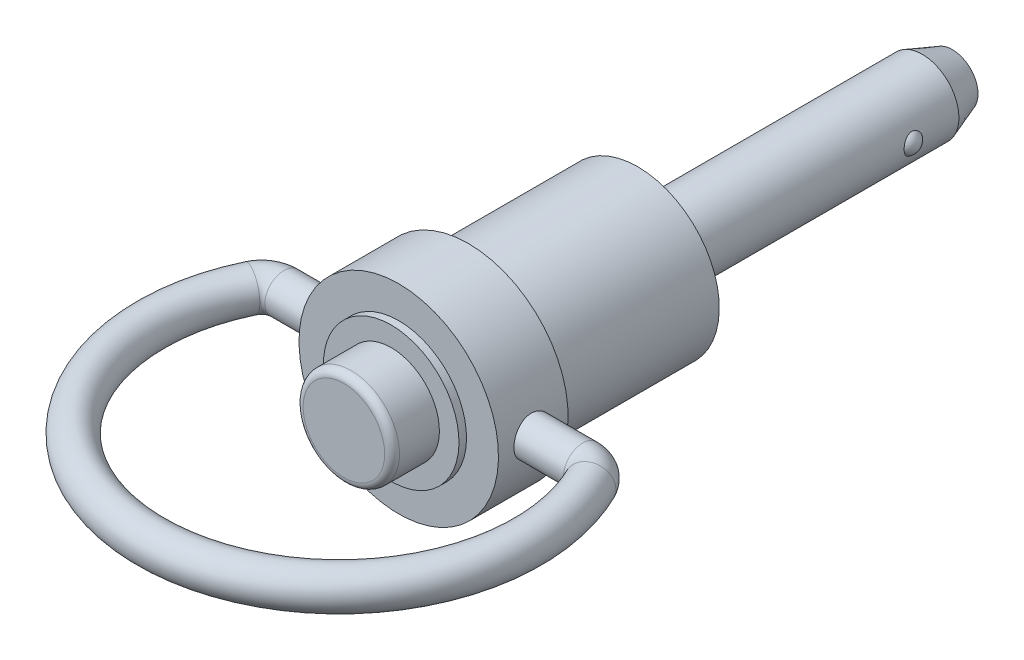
ISO-10303-21;
HEADER;
FILE_DESCRIPTION(('STEP AP214'),'2;1');
FILE_NAME('part.step','',(''),(''),'','','');
FILE_SCHEMA(('AUTOMOTIVE_DESIGN { 1 0 10303 214 1 1 1 1 }'));
ENDSEC;
DATA;
#1=APPLICATION_CONTEXT('core data for automotive mechanical design processes');
#2=APPLICATION_PROTOCOL_DEFINITION('international standard','automotive_design',2000,#1);
#3=PRODUCT_CONTEXT('',#1,'mechanical');
#4=PRODUCT('Part','Part','',(#3));
#5=PRODUCT_RELATED_PRODUCT_CATEGORY('part','',(#4));
#6=PRODUCT_DEFINITION_FORMATION('','',#4);
#7=PRODUCT_DEFINITION_CONTEXT('part definition',#1,'design');
#8=PRODUCT_DEFINITION('design','',#6,#7);
#9=PRODUCT_DEFINITION_SHAPE('','',#8);
#10=(LENGTH_UNIT() NAMED_UNIT(*) SI_UNIT(.MILLI.,.METRE.));
#11=(NAMED_UNIT(*) PLANE_ANGLE_UNIT() SI_UNIT($,.RADIAN.));
#12=(NAMED_UNIT(*) SI_UNIT($,.STERADIAN.) SOLID_ANGLE_UNIT());
#13=UNCERTAINTY_MEASURE_WITH_UNIT(LENGTH_MEASURE(1.E-05),#10,'distance_accuracy_value','');
#14=(GEOMETRIC_REPRESENTATION_CONTEXT(3) GLOBAL_UNCERTAINTY_ASSIGNED_CONTEXT((#13)) GLOBAL_UNIT_ASSIGNED_CONTEXT((#10,
#11,#12)) REPRESENTATION_CONTEXT('',''));
#15=CARTESIAN_POINT('',(0.,0.,0.));
#16=DIRECTION('',(0.,0.,1.));
#17=DIRECTION('',(1.,0.,0.));
#18=AXIS2_PLACEMENT_3D('',#15,#16,#17);
#19=CARTESIAN_POINT('',(0.,0.,19.828));
#20=DIRECTION('',(0.,0.,-1.));
#21=DIRECTION('',(-1.,0.,0.));
#22=AXIS2_PLACEMENT_3D('',#19,#20,#21);
#23=PLANE('',#22);
#24=CARTESIAN_POINT('',(0.,0.,19.828));
#25=DIRECTION('',(0.,0.,1.));
#26=DIRECTION('',(1.,0.,0.));
#27=AXIS2_PLACEMENT_3D('',#24,#25,#26);
#28=CIRCLE('',#27,2.7512);
#29=CARTESIAN_POINT('',(2.7512,0.,19.828));
#30=VERTEX_POINT('',#29);
#31=EDGE_CURVE('E211',#30,#30,#28,.T.);
#32=ORIENTED_EDGE('',*,*,#31,.T.);
#33=EDGE_LOOP('',(#32));
#34=FACE_BOUND('',#33,.T.);
#35=ADVANCED_FACE('F13',(#34),#23,.F.);
#36=CARTESIAN_POINT('',(0.,0.,19.328));
#37=DIRECTION('',(0.,0.,1.));
#38=DIRECTION('',(1.,0.,0.));
#39=AXIS2_PLACEMENT_3D('',#36,#37,#38);
#40=TOROIDAL_SURFACE('',#39,2.7512,0.5);
#41=ORIENTED_EDGE('',*,*,#31,.F.);
#42=EDGE_LOOP('',(#41));
#43=FACE_BOUND('',#42,.T.);
#44=CARTESIAN_POINT('',(0.,0.,19.328));
#45=DIRECTION('',(0.,0.,1.));
#46=DIRECTION('',(1.,0.,0.));
#47=AXIS2_PLACEMENT_3D('',#44,#45,#46);
#48=CIRCLE('',#47,3.2512);
#49=CARTESIAN_POINT('',(3.2512,0.,19.328));
#50=VERTEX_POINT('',#49);
#51=EDGE_CURVE('E103',#50,#50,#48,.T.);
#52=ORIENTED_EDGE('',*,*,#51,.T.);
#53=EDGE_LOOP('',(#52));
#54=FACE_BOUND('',#53,.T.);
#55=ADVANCED_FACE('F69',(#43,#54),#40,.T.);
#56=CARTESIAN_POINT('',(0.,0.,20.828));
#57=DIRECTION('',(0.,0.,-1.));
#58=DIRECTION('',(0.,1.,0.));
#59=AXIS2_PLACEMENT_3D('',#56,#57,#58);
#60=CYLINDRICAL_SURFACE('',#59,3.2512);
#61=CARTESIAN_POINT('',(0.,0.,16.637));
#62=DIRECTION('',(0.,0.,-1.));
#63=DIRECTION('',(0.,1.,0.));
#64=AXIS2_PLACEMENT_3D('',#61,#62,#63);
#65=CIRCLE('',#64,3.2512);
#66=CARTESIAN_POINT('',(0.,3.2512,16.637));
#67=VERTEX_POINT('',#66);
#68=EDGE_CURVE('E145',#67,#67,#65,.T.);
#69=ORIENTED_EDGE('',*,*,#68,.F.);
#70=EDGE_LOOP('',(#69));
#71=FACE_BOUND('',#70,.T.);
#72=ORIENTED_EDGE('',*,*,#51,.F.);
#73=EDGE_LOOP('',(#72));
#74=FACE_BOUND('',#73,.T.);
#75=ADVANCED_FACE('F75',(#71,#74),#60,.T.);
#76=CARTESIAN_POINT('',(0.,0.,20.1422));
#77=DIRECTION('',(0.,1.,0.));
#78=DIRECTION('',(-1.,0.,0.));
#79=AXIS2_PLACEMENT_3D('',#76,#77,#78);
#80=TOROIDAL_SURFACE('',#79,12.7,1.2954);
#81=CARTESIAN_POINT('',(-11.4549005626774,0.,14.6581090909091));
#82=DIRECTION('',(-0.43181818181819,0.,0.901960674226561));
#83=DIRECTION('',(-0.901960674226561,0.,-0.43181818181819));
#84=AXIS2_PLACEMENT_3D('',#81,#82,#83);
#85=CIRCLE('',#84,1.2954);
#86=CARTESIAN_POINT('',(-12.6233004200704,0.,14.0987318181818));
#87=VERTEX_POINT('',#86);
#88=EDGE_CURVE('E164',#87,#87,#85,.F.);
#89=ORIENTED_EDGE('',*,*,#88,.F.);
#90=EDGE_LOOP('',(#89));
#91=FACE_BOUND('',#90,.T.);
#92=CARTESIAN_POINT('',(11.4549005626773,0.,14.658109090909));
#93=DIRECTION('',(-0.431818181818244,0.,-0.901960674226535));
#94=DIRECTION('',(0.901960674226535,0.,-0.431818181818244));
#95=AXIS2_PLACEMENT_3D('',#92,#93,#94);
#96=CIRCLE('',#95,1.2954);
#97=CARTESIAN_POINT('',(12.6233004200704,0.,14.0987318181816));
#98=VERTEX_POINT('',#97);
#99=EDGE_CURVE('E161',#98,#98,#96,.T.);
#100=ORIENTED_EDGE('',*,*,#99,.F.);
#101=EDGE_LOOP('',(#100));
#102=FACE_BOUND('',#101,.T.);
#103=ADVANCED_FACE('F84',(#91,#102),#80,.T.);
#104=CARTESIAN_POINT('',(4.572,0.,16.637));
#105=DIRECTION('',(0.,0.,1.));
#106=DIRECTION('',(0.,-1.,0.));
#107=AXIS2_PLACEMENT_3D('',#104,#105,#106);
#108=PLANE('',#107);
#109=ORIENTED_EDGE('',*,*,#68,.T.);
#110=EDGE_LOOP('',(#109));
#111=FACE_BOUND('',#110,.T.);
#112=CARTESIAN_POINT('',(0.,0.,16.637));
#113=DIRECTION('',(0.,0.,-1.));
#114=DIRECTION('',(0.,1.,0.));
#115=AXIS2_PLACEMENT_3D('',#112,#113,#114);
#116=CIRCLE('',#115,4.572);
#117=CARTESIAN_POINT('',(0.,4.572,16.637));
#118=VERTEX_POINT('',#117);
#119=EDGE_CURVE('E150',#118,#118,#116,.T.);
#120=ORIENTED_EDGE('',*,*,#119,.F.);
#121=EDGE_LOOP('',(#120));
#122=FACE_BOUND('',#121,.T.);
#123=ADVANCED_FACE('F113',(#111,#122),#108,.T.);
#124=CARTESIAN_POINT('',(10.0803124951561,0.,15.3162));
#125=DIRECTION('',(0.,1.,0.));
#126=DIRECTION('',(-1.,0.,0.));
#127=AXIS2_PLACEMENT_3D('',#124,#125,#126);
#128=TOROIDAL_SURFACE('',#127,1.524,1.2954);
#129=ORIENTED_EDGE('',*,*,#99,.T.);
#130=EDGE_LOOP('',(#129));
#131=FACE_BOUND('',#130,.T.);
#132=CARTESIAN_POINT('',(10.0803124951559,0.,13.7922));
#133=DIRECTION('',(1.,0.,0.));
#134=DIRECTION('',(0.,1.,0.));
#135=AXIS2_PLACEMENT_3D('',#132,#133,#134);
#136=CIRCLE('',#135,1.2954);
#137=CARTESIAN_POINT('',(10.0803124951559,1.2954,13.7922));
#138=VERTEX_POINT('',#137);
#139=EDGE_CURVE('E149',#138,#138,#136,.F.);
#140=ORIENTED_EDGE('',*,*,#139,.F.);
#141=EDGE_LOOP('',(#140));
#142=FACE_BOUND('',#141,.T.);
#143=ADVANCED_FACE('F177',(#131,#142),#128,.T.);
#144=CARTESIAN_POINT('',(-10.0803124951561,0.,15.3162));
#145=DIRECTION('',(0.,1.,0.));
#146=DIRECTION('',(-1.,0.,0.));
#147=AXIS2_PLACEMENT_3D('',#144,#145,#146);
#148=TOROIDAL_SURFACE('',#147,1.524,1.2954);
#149=CARTESIAN_POINT('',(-10.0803124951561,0.,13.7922));
#150=DIRECTION('',(1.,0.,0.));
#151=DIRECTION('',(0.,1.,0.));
#152=AXIS2_PLACEMENT_3D('',#149,#150,#151);
#153=CIRCLE('',#152,1.2954);
#154=CARTESIAN_POINT('',(-10.0803124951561,1.2954,13.7922));
#155=VERTEX_POINT('',#154);
#156=EDGE_CURVE('E148',#155,#155,#153,.T.);
#157=ORIENTED_EDGE('',*,*,#156,.F.);
#158=EDGE_LOOP('',(#157));
#159=FACE_BOUND('',#158,.T.);
#160=ORIENTED_EDGE('',*,*,#88,.T.);
#161=EDGE_LOOP('',(#160));
#162=FACE_BOUND('',#161,.T.);
#163=ADVANCED_FACE('F117',(#159,#162),#148,.T.);
#164=CARTESIAN_POINT('',(0.,0.,0.));
#165=DIRECTION('',(0.,0.,-1.));
#166=DIRECTION('',(0.,1.,0.));
#167=AXIS2_PLACEMENT_3D('',#164,#165,#166);
#168=CYLINDRICAL_SURFACE('',#167,4.572);
#169=ORIENTED_EDGE('',*,*,#119,.T.);
#170=EDGE_LOOP('',(#169));
#171=FACE_BOUND('',#170,.T.);
#172=CARTESIAN_POINT('',(0.,0.,16.129));
#173=DIRECTION('',(0.,0.,-1.));
#174=DIRECTION('',(0.,1.,0.));
#175=AXIS2_PLACEMENT_3D('',#172,#173,#174);
#176=CIRCLE('',#175,4.572);
#177=CARTESIAN_POINT('',(0.,4.572,16.129));
#178=VERTEX_POINT('',#177);
#179=EDGE_CURVE('E153',#178,#178,#176,.T.);
#180=ORIENTED_EDGE('',*,*,#179,.F.);
#181=EDGE_LOOP('',(#180));
#182=FACE_BOUND('',#181,.T.);
#183=ADVANCED_FACE('F114',(#171,#182),#168,.T.);
#184=CARTESIAN_POINT('',(-10.0803124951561,0.,13.7922));
#185=DIRECTION('',(1.,0.,0.));
#186=DIRECTION('',(0.,1.,0.));
#187=AXIS2_PLACEMENT_3D('',#184,#185,#186);
#188=CYLINDRICAL_SURFACE('',#187,1.2954);
#189=CARTESIAN_POINT('',(6.6051722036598,1.2954,13.7922));
#190=CARTESIAN_POINT('',(6.60517361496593,1.2953972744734,13.720163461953));
#191=CARTESIAN_POINT('',(6.60636346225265,1.2893707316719,13.6480919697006));
#192=CARTESIAN_POINT('',(6.61098794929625,1.26544153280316,13.5059837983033));
#193=CARTESIAN_POINT('',(6.61442445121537,1.24752902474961,13.4359488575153));
#194=CARTESIAN_POINT('',(6.62313895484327,1.20040052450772,13.2999904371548));
#195=CARTESIAN_POINT('',(6.62841519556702,1.17119533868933,13.2340630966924));
#196=CARTESIAN_POINT('',(6.64021258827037,1.10233951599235,13.1080471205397));
#197=CARTESIAN_POINT('',(6.64673365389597,1.06268960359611,13.0479580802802));
#198=CARTESIAN_POINT('',(6.66038139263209,0.973516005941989,12.9345330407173));
#199=CARTESIAN_POINT('',(6.66751428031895,0.923881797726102,12.8812846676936));
#200=CARTESIAN_POINT('',(6.68152715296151,0.816387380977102,12.7838165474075));
#201=CARTESIAN_POINT('',(6.6884071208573,0.758526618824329,12.7395974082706));
#202=CARTESIAN_POINT('',(6.7012057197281,0.635644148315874,12.6611055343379));
#203=CARTESIAN_POINT('',(6.70711617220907,0.570568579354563,12.6269156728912));
#204=CARTESIAN_POINT('',(6.71724013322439,0.435464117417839,12.569987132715));
#205=CARTESIAN_POINT('',(6.72145378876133,0.36543565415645,12.5472474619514));
#206=CARTESIAN_POINT('',(6.72766549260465,0.223321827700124,12.5141364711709));
#207=CARTESIAN_POINT('',(6.72968999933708,0.151272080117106,12.5036173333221));
#208=CARTESIAN_POINT('',(6.73138656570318,0.00640388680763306,12.494785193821));
#209=CARTESIAN_POINT('',(6.73105883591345,-0.0664144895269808,12.4964710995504));
#210=CARTESIAN_POINT('',(6.72810846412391,-0.209738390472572,12.511888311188));
#211=CARTESIAN_POINT('',(6.72551615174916,-0.280261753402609,12.5254604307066));
#212=CARTESIAN_POINT('',(6.71836197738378,-0.418011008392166,12.5640127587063));
#213=CARTESIAN_POINT('',(6.71380004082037,-0.4852367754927,12.5889933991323));
#214=CARTESIAN_POINT('',(6.70316878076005,-0.614941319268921,12.6498036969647));
#215=CARTESIAN_POINT('',(6.69709072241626,-0.67738974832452,12.6856964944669));
#216=CARTESIAN_POINT('',(6.68409856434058,-0.795436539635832,12.7672656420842));
#217=CARTESIAN_POINT('',(6.677184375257,-0.851034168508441,12.8129430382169));
#218=CARTESIAN_POINT('',(6.66315320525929,-0.954744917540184,12.9136604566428));
#219=CARTESIAN_POINT('',(6.65603475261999,-1.00272266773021,12.9688397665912));
#220=CARTESIAN_POINT('',(6.64250376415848,-1.08876420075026,13.0865320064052));
#221=CARTESIAN_POINT('',(6.63609123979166,-1.12682782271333,13.1490450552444));
#222=CARTESIAN_POINT('',(6.62469571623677,-1.19200234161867,13.2798155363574));
#223=CARTESIAN_POINT('',(6.61971540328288,-1.21909269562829,13.3480834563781));
#224=CARTESIAN_POINT('',(6.61178862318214,-1.26138008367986,13.4883195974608));
#225=CARTESIAN_POINT('',(6.60884191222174,-1.27657854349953,13.5602873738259));
#226=CARTESIAN_POINT('',(6.60536444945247,-1.29445125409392,13.7046572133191));
#227=CARTESIAN_POINT('',(6.60479610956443,-1.29732037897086,13.7770342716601));
#228=CARTESIAN_POINT('',(6.60603903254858,-1.29097613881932,13.9212330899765));
#229=CARTESIAN_POINT('',(6.60785017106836,-1.28176340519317,13.9930548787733));
#230=CARTESIAN_POINT('',(6.6136128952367,-1.25168453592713,14.1334581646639));
#231=CARTESIAN_POINT('',(6.61754556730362,-1.23092132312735,14.2020625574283));
#232=CARTESIAN_POINT('',(6.62709183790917,-1.17844042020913,14.334818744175));
#233=CARTESIAN_POINT('',(6.63270556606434,-1.14672188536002,14.3989701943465));
#234=CARTESIAN_POINT('',(6.64506657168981,-1.07278507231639,14.5218557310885));
#235=CARTESIAN_POINT('',(6.65182676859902,-1.03044414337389,14.5805146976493));
#236=CARTESIAN_POINT('',(6.66568301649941,-0.936629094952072,14.6899658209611));
#237=CARTESIAN_POINT('',(6.67277909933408,-0.885154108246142,14.7407572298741));
#238=CARTESIAN_POINT('',(6.68662882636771,-0.773660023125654,14.8337637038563));
#239=CARTESIAN_POINT('',(6.69337621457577,-0.713530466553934,14.8758474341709));
#240=CARTESIAN_POINT('',(6.70566168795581,-0.586941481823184,14.9493152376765));
#241=CARTESIAN_POINT('',(6.71119982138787,-0.520482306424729,14.9806997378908));
#242=CARTESIAN_POINT('',(6.72041595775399,-0.383476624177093,15.0316835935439));
#243=CARTESIAN_POINT('',(6.72410395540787,-0.31295442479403,15.0513463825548));
#244=CARTESIAN_POINT('',(6.72924701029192,-0.169530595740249,15.0785305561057));
#245=CARTESIAN_POINT('',(6.7307023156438,-0.0966292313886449,15.0860532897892));
#246=CARTESIAN_POINT('',(6.73121071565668,0.0482259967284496,15.0886947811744));
#247=CARTESIAN_POINT('',(6.73030215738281,0.120176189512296,15.0840115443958));
#248=CARTESIAN_POINT('',(6.72626496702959,0.262244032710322,15.0628090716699));
#249=CARTESIAN_POINT('',(6.72313635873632,0.332361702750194,15.0462899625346));
#250=CARTESIAN_POINT('',(6.71501101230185,0.46866216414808,15.0019698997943));
#251=CARTESIAN_POINT('',(6.710017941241,0.534852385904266,14.9741910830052));
#252=CARTESIAN_POINT('',(6.69870305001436,0.661661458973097,14.9081643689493));
#253=CARTESIAN_POINT('',(6.69238113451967,0.722279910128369,14.8699157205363));
#254=CARTESIAN_POINT('',(6.6789853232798,0.837208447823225,14.7833588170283));
#255=CARTESIAN_POINT('',(6.67190155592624,0.891410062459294,14.7349080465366));
#256=CARTESIAN_POINT('',(6.65784127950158,0.990982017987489,14.62961686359));
#257=CARTESIAN_POINT('',(6.65086479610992,1.03635027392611,14.5727744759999));
#258=CARTESIAN_POINT('',(6.63773378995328,1.1173887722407,14.4516440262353));
#259=CARTESIAN_POINT('',(6.63158802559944,1.15295925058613,14.3872882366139));
#260=CARTESIAN_POINT('',(6.62092027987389,1.21272619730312,14.2534152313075));
#261=CARTESIAN_POINT('',(6.61639678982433,1.23693323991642,14.1839028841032));
#262=CARTESIAN_POINT('',(6.61041337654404,1.26845390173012,14.0605363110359));
#263=CARTESIAN_POINT('',(6.60845980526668,1.27854107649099,14.00739730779));
#264=CARTESIAN_POINT('',(6.60583870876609,1.29201504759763,13.9002454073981));
#265=CARTESIAN_POINT('',(6.60517114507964,1.29540204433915,13.8462325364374));
#266=CARTESIAN_POINT('',(6.6051722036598,1.2954,13.7922));
#267=B_SPLINE_CURVE_WITH_KNOTS('',3,(#189,#190,#191,#192,#193,#194,#195,#196,#197,#198,#199,
#200,#201,#202,#203,#204,#205,#206,#207,#208,#209,#210,#211,#212,#213,#214,#215,#216,#217,#218,
#219,#220,#221,#222,#223,#224,#225,#226,#227,#228,#229,#230,#231,#232,#233,#234,#235,#236,#237,
#238,#239,#240,#241,#242,#243,#244,#245,#246,#247,#248,#249,#250,#251,#252,#253,#254,#255,#256,
#257,#258,#259,#260,#261,#262,#263,#264,#265,#266),.UNSPECIFIED.,.T.,.F.,(4,2,2,2,2,2,2,2,2,2,2,
2,2,2,2,2,2,2,2,2,2,2,2,2,2,2,2,2,2,2,2,2,2,2,2,2,2,2,4),(0.,0.215911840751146,
0.432002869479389,0.64788762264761,0.86375740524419,1.08216318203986,1.30058366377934,
1.52076118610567,1.74091962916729,1.95838638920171,2.1758336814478,2.39041258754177,
2.60499961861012,2.82085272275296,3.0367289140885,3.25609136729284,3.47545737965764,
3.69523218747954,3.91498064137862,4.13124273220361,4.34749352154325,4.56184753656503,
4.77621808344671,4.99318797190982,5.21017847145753,5.43023526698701,5.65028327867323,
5.86912939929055,6.08795119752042,6.30324544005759,6.51853737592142,6.73340808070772,
6.94829420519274,7.16640910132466,7.38457541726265,7.60488731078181,7.82499378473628,
7.98694789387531,8.14889715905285),.UNSPECIFIED.);
#268=CARTESIAN_POINT('',(6.6051722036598,1.2954,13.7922));
#269=VERTEX_POINT('',#268);
#270=EDGE_CURVE('E89',#269,#269,#267,.T.);
#271=ORIENTED_EDGE('',*,*,#270,.F.);
#272=EDGE_LOOP('',(#271));
#273=FACE_BOUND('',#272,.T.);
#274=ORIENTED_EDGE('',*,*,#139,.T.);
#275=EDGE_LOOP('',(#274));
#276=FACE_BOUND('',#275,.T.);
#277=ADVANCED_FACE('F111',(#273,#276),#188,.T.);
#278=CARTESIAN_POINT('',(-10.0803124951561,0.,13.7922));
#279=DIRECTION('',(1.,0.,0.));
#280=DIRECTION('',(0.,1.,0.));
#281=AXIS2_PLACEMENT_3D('',#278,#279,#280);
#282=CYLINDRICAL_SURFACE('',#281,1.2954);
#283=CARTESIAN_POINT('',(-6.6051722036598,1.2954,13.7922));
#284=CARTESIAN_POINT('',(-6.60517361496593,1.2953972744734,13.864236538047));
#285=CARTESIAN_POINT('',(-6.60636346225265,1.28937073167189,13.9363080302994));
#286=CARTESIAN_POINT('',(-6.61098794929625,1.26544153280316,14.0784162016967));
#287=CARTESIAN_POINT('',(-6.61442445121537,1.24752902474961,14.1484511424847));
#288=CARTESIAN_POINT('',(-6.62313895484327,1.20040052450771,14.2844095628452));
#289=CARTESIAN_POINT('',(-6.62841519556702,1.17119533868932,14.3503369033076));
#290=CARTESIAN_POINT('',(-6.64021258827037,1.10233951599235,14.4763528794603));
#291=CARTESIAN_POINT('',(-6.64673365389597,1.06268960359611,14.5364419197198));
#292=CARTESIAN_POINT('',(-6.66038139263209,0.973516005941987,14.6498669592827));
#293=CARTESIAN_POINT('',(-6.66751428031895,0.9238817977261,14.7031153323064));
#294=CARTESIAN_POINT('',(-6.68152715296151,0.816387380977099,14.8005834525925));
#295=CARTESIAN_POINT('',(-6.6884071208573,0.758526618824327,14.8448025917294));
#296=CARTESIAN_POINT('',(-6.7012057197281,0.635644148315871,14.9232944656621));
#297=CARTESIAN_POINT('',(-6.70711617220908,0.570568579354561,14.9574843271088));
#298=CARTESIAN_POINT('',(-6.71724013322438,0.435464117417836,15.014412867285));
#299=CARTESIAN_POINT('',(-6.72145378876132,0.365435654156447,15.0371525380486));
#300=CARTESIAN_POINT('',(-6.72766549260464,0.223321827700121,15.0702635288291));
#301=CARTESIAN_POINT('',(-6.72968999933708,0.151272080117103,15.0807826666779));
#302=CARTESIAN_POINT('',(-6.73138656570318,0.00640388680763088,15.089614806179));
#303=CARTESIAN_POINT('',(-6.73105883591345,-0.0664144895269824,15.0879289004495));
#304=CARTESIAN_POINT('',(-6.72810846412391,-0.209738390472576,15.072511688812));
#305=CARTESIAN_POINT('',(-6.72551615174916,-0.280261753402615,15.0589395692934));
#306=CARTESIAN_POINT('',(-6.71836197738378,-0.418011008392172,15.0203872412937));
#307=CARTESIAN_POINT('',(-6.71380004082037,-0.485236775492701,14.9954066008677));
#308=CARTESIAN_POINT('',(-6.70316878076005,-0.614941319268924,14.9345963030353));
#309=CARTESIAN_POINT('',(-6.69709072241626,-0.67738974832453,14.8987035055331));
#310=CARTESIAN_POINT('',(-6.68409856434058,-0.795436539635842,14.8171343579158));
#311=CARTESIAN_POINT('',(-6.677184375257,-0.851034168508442,14.7714569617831));
#312=CARTESIAN_POINT('',(-6.66315320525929,-0.954744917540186,14.6707395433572));
#313=CARTESIAN_POINT('',(-6.65603475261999,-1.00272266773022,14.6155602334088));
#314=CARTESIAN_POINT('',(-6.64250376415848,-1.08876420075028,14.4978679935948));
#315=CARTESIAN_POINT('',(-6.63609123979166,-1.12682782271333,14.4353549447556));
#316=CARTESIAN_POINT('',(-6.62469571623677,-1.19200234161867,14.3045844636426));
#317=CARTESIAN_POINT('',(-6.61971540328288,-1.21909269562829,14.2363165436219));
#318=CARTESIAN_POINT('',(-6.61178862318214,-1.26138008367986,14.0960804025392));
#319=CARTESIAN_POINT('',(-6.60884191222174,-1.27657854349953,14.0241126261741));
#320=CARTESIAN_POINT('',(-6.60536444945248,-1.29445125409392,13.8797427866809));
#321=CARTESIAN_POINT('',(-6.60479610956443,-1.29732037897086,13.8073657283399));
#322=CARTESIAN_POINT('',(-6.60603903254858,-1.29097613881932,13.6631669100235));
#323=CARTESIAN_POINT('',(-6.60785017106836,-1.28176340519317,13.5913451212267));
#324=CARTESIAN_POINT('',(-6.6136128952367,-1.25168453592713,13.4509418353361));
#325=CARTESIAN_POINT('',(-6.61754556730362,-1.23092132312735,13.3823374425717));
#326=CARTESIAN_POINT('',(-6.62709183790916,-1.17844042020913,13.249581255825));
#327=CARTESIAN_POINT('',(-6.63270556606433,-1.14672188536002,13.1854298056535));
#328=CARTESIAN_POINT('',(-6.6450665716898,-1.07278507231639,13.0625442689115));
#329=CARTESIAN_POINT('',(-6.65182676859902,-1.03044414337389,13.0038853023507));
#330=CARTESIAN_POINT('',(-6.66568301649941,-0.936629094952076,12.8944341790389));
#331=CARTESIAN_POINT('',(-6.67277909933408,-0.885154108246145,12.8436427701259));
#332=CARTESIAN_POINT('',(-6.68662882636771,-0.773660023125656,12.7506362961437));
#333=CARTESIAN_POINT('',(-6.69337621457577,-0.713530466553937,12.7085525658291));
#334=CARTESIAN_POINT('',(-6.70566168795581,-0.586941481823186,12.6350847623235));
#335=CARTESIAN_POINT('',(-6.71119982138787,-0.520482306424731,12.6037002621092));
#336=CARTESIAN_POINT('',(-6.72041595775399,-0.383476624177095,12.5527164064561));
#337=CARTESIAN_POINT('',(-6.72410395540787,-0.312954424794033,12.5330536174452));
#338=CARTESIAN_POINT('',(-6.72924701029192,-0.169530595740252,12.5058694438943));
#339=CARTESIAN_POINT('',(-6.7307023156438,-0.0966292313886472,12.4983467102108));
#340=CARTESIAN_POINT('',(-6.73121071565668,0.0482259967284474,12.4957052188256));
#341=CARTESIAN_POINT('',(-6.73030215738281,0.120176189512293,12.5003884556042));
#342=CARTESIAN_POINT('',(-6.72626496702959,0.26224403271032,12.5215909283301));
#343=CARTESIAN_POINT('',(-6.72313635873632,0.332361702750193,12.5381100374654));
#344=CARTESIAN_POINT('',(-6.71501101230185,0.468662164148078,12.5824301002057));
#345=CARTESIAN_POINT('',(-6.710017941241,0.534852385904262,12.6102089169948));
#346=CARTESIAN_POINT('',(-6.69870305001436,0.661661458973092,12.6762356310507));
#347=CARTESIAN_POINT('',(-6.69238113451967,0.722279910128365,12.7144842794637));
#348=CARTESIAN_POINT('',(-6.6789853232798,0.837208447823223,12.8010411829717));
#349=CARTESIAN_POINT('',(-6.67190155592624,0.891410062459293,12.8494919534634));
#350=CARTESIAN_POINT('',(-6.65784127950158,0.990982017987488,12.95478313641));
#351=CARTESIAN_POINT('',(-6.65086479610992,1.03635027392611,13.0116255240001));
#352=CARTESIAN_POINT('',(-6.63773378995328,1.11738877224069,13.1327559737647));
#353=CARTESIAN_POINT('',(-6.63158802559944,1.15295925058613,13.1971117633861));
#354=CARTESIAN_POINT('',(-6.62092027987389,1.21272619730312,13.3309847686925));
#355=CARTESIAN_POINT('',(-6.61639678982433,1.23693323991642,13.4004971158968));
#356=CARTESIAN_POINT('',(-6.61041337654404,1.26845390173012,13.5238636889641));
#357=CARTESIAN_POINT('',(-6.60845980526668,1.27854107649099,13.57700269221));
#358=CARTESIAN_POINT('',(-6.60583870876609,1.29201504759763,13.6841545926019));
#359=CARTESIAN_POINT('',(-6.60517114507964,1.29540204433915,13.7381674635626));
#360=CARTESIAN_POINT('',(-6.6051722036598,1.2954,13.7922));
#361=B_SPLINE_CURVE_WITH_KNOTS('',3,(#283,#284,#285,#286,#287,#288,#289,#290,#291,#292,#293,
#294,#295,#296,#297,#298,#299,#300,#301,#302,#303,#304,#305,#306,#307,#308,#309,#310,#311,#312,
#313,#314,#315,#316,#317,#318,#319,#320,#321,#322,#323,#324,#325,#326,#327,#328,#329,#330,#331,
#332,#333,#334,#335,#336,#337,#338,#339,#340,#341,#342,#343,#344,#345,#346,#347,#348,#349,#350,
#351,#352,#353,#354,#355,#356,#357,#358,#359,#360),.UNSPECIFIED.,.T.,.F.,(4,2,2,2,2,2,2,2,2,2,2,
2,2,2,2,2,2,2,2,2,2,2,2,2,2,2,2,2,2,2,2,2,2,2,2,2,2,2,4),(0.,0.215911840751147,
0.432002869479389,0.64788762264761,0.86375740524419,1.08216318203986,1.30058366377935,
1.52076118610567,1.74091962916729,1.95838638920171,2.1758336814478,2.39041258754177,
2.60499961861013,2.82085272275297,3.0367289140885,3.25609136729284,3.47545737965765,
3.69523218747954,3.91498064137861,4.13124273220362,4.34749352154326,4.56184753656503,
4.7762180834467,4.99318797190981,5.21017847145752,5.430235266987,5.65028327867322,
5.86912939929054,6.08795119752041,6.30324544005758,6.51853737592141,6.73340808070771,
6.94829420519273,7.16640910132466,7.38457541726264,7.60488731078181,7.82499378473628,
7.9869478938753,8.14889715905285),.UNSPECIFIED.);
#362=CARTESIAN_POINT('',(-6.6051722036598,1.2954,13.7922));
#363=VERTEX_POINT('',#362);
#364=EDGE_CURVE('E95',#363,#363,#361,.T.);
#365=ORIENTED_EDGE('',*,*,#364,.F.);
#366=EDGE_LOOP('',(#365));
#367=FACE_BOUND('',#366,.T.);
#368=ORIENTED_EDGE('',*,*,#156,.T.);
#369=EDGE_LOOP('',(#368));
#370=FACE_BOUND('',#369,.T.);
#371=ADVANCED_FACE('F105',(#367,#370),#282,.T.);
#372=CARTESIAN_POINT('',(6.731,0.,16.129));
#373=DIRECTION('',(0.,0.,1.));
#374=DIRECTION('',(0.,-1.,0.));
#375=AXIS2_PLACEMENT_3D('',#372,#373,#374);
#376=PLANE('',#375);
#377=CARTESIAN_POINT('',(0.,0.,16.129));
#378=DIRECTION('',(0.,0.,-1.));
#379=DIRECTION('',(0.,1.,0.));
#380=AXIS2_PLACEMENT_3D('',#377,#378,#379);
#381=CIRCLE('',#380,6.731);
#382=CARTESIAN_POINT('',(0.,6.731,16.129));
#383=VERTEX_POINT('',#382);
#384=EDGE_CURVE('E156',#383,#383,#381,.T.);
#385=ORIENTED_EDGE('',*,*,#384,.F.);
#386=EDGE_LOOP('',(#385));
#387=FACE_BOUND('',#386,.T.);
#388=ORIENTED_EDGE('',*,*,#179,.T.);
#389=EDGE_LOOP('',(#388));
#390=FACE_BOUND('',#389,.T.);
#391=ADVANCED_FACE('F110',(#387,#390),#376,.T.);
#392=CARTESIAN_POINT('',(0.,0.,0.));
#393=DIRECTION('',(0.,0.,-1.));
#394=DIRECTION('',(0.,1.,0.));
#395=AXIS2_PLACEMENT_3D('',#392,#393,#394);
#396=CYLINDRICAL_SURFACE('',#395,6.731);
#397=CARTESIAN_POINT('',(0.,0.,11.43));
#398=DIRECTION('',(0.,0.,-1.));
#399=DIRECTION('',(0.,1.,0.));
#400=AXIS2_PLACEMENT_3D('',#397,#398,#399);
#401=CIRCLE('',#400,6.731);
#402=CARTESIAN_POINT('',(0.,6.731,11.43));
#403=VERTEX_POINT('',#402);
#404=EDGE_CURVE('E102',#403,#403,#401,.T.);
#405=ORIENTED_EDGE('',*,*,#404,.F.);
#406=EDGE_LOOP('',(#405));
#407=FACE_BOUND('',#406,.T.);
#408=ORIENTED_EDGE('',*,*,#384,.T.);
#409=EDGE_LOOP('',(#408));
#410=FACE_BOUND('',#409,.T.);
#411=ORIENTED_EDGE('',*,*,#364,.T.);
#412=EDGE_LOOP('',(#411));
#413=FACE_BOUND('',#412,.T.);
#414=ORIENTED_EDGE('',*,*,#270,.T.);
#415=EDGE_LOOP('',(#414));
#416=FACE_BOUND('',#415,.T.);
#417=ADVANCED_FACE('F121',(#407,#410,#413,#416),#396,.T.);
#418=CARTESIAN_POINT('',(5.7785,0.,11.43));
#419=DIRECTION('',(0.,0.,-1.));
#420=DIRECTION('',(0.,1.,0.));
#421=AXIS2_PLACEMENT_3D('',#418,#419,#420);
#422=PLANE('',#421);
#423=CARTESIAN_POINT('',(0.,0.,11.43));
#424=DIRECTION('',(0.,0.,-1.));
#425=DIRECTION('',(0.,1.,0.));
#426=AXIS2_PLACEMENT_3D('',#423,#424,#425);
#427=CIRCLE('',#426,5.9);
#428=CARTESIAN_POINT('',(0.,5.9,11.43));
#429=VERTEX_POINT('',#428);
#430=EDGE_CURVE('E26',#429,#429,#427,.F.);
#431=ORIENTED_EDGE('',*,*,#430,.T.);
#432=EDGE_LOOP('',(#431));
#433=FACE_BOUND('',#432,.T.);
#434=ORIENTED_EDGE('',*,*,#404,.T.);
#435=EDGE_LOOP('',(#434));
#436=FACE_BOUND('',#435,.T.);
#437=ADVANCED_FACE('F125',(#433,#436),#422,.T.);
#438=CARTESIAN_POINT('',(0.,0.,11.03));
#439=DIRECTION('',(0.,0.,-1.));
#440=DIRECTION('',(0.,1.,0.));
#441=AXIS2_PLACEMENT_3D('',#438,#439,#440);
#442=TOROIDAL_SURFACE('',#441,5.9,0.4);
#443=CARTESIAN_POINT('',(0.,0.,11.03));
#444=DIRECTION('',(0.,0.,-1.));
#445=DIRECTION('',(0.,1.,0.));
#446=AXIS2_PLACEMENT_3D('',#443,#444,#445);
#447=CIRCLE('',#446,5.5);
#448=CARTESIAN_POINT('',(0.,5.5,11.03));
#449=VERTEX_POINT('',#448);
#450=EDGE_CURVE('E21',#449,#449,#447,.T.);
#451=ORIENTED_EDGE('',*,*,#450,.F.);
#452=EDGE_LOOP('',(#451));
#453=FACE_BOUND('',#452,.T.);
#454=ORIENTED_EDGE('',*,*,#430,.F.);
#455=EDGE_LOOP('',(#454));
#456=FACE_BOUND('',#455,.T.);
#457=ADVANCED_FACE('F129',(#453,#456),#442,.F.);
#458=CARTESIAN_POINT('',(0.,0.,42.1857590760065));
#459=DIRECTION('',(0.,0.,-1.));
#460=DIRECTION('',(0.,1.,0.));
#461=AXIS2_PLACEMENT_3D('',#458,#459,#460);
#462=CYLINDRICAL_SURFACE('',#461,5.5);
#463=ORIENTED_EDGE('',*,*,#450,.T.);
#464=EDGE_LOOP('',(#463));
#465=FACE_BOUND('',#464,.T.);
#466=CARTESIAN_POINT('',(0.,0.,0.));
#467=DIRECTION('',(0.,0.,-1.));
#468=DIRECTION('',(0.,1.,0.));
#469=AXIS2_PLACEMENT_3D('',#466,#467,#468);
#470=CIRCLE('',#469,5.5);
#471=CARTESIAN_POINT('',(0.,5.5,0.));
#472=VERTEX_POINT('',#471);
#473=EDGE_CURVE('E212',#472,#472,#470,.T.);
#474=ORIENTED_EDGE('',*,*,#473,.F.);
#475=EDGE_LOOP('',(#474));
#476=FACE_BOUND('',#475,.T.);
#477=ADVANCED_FACE('F80',(#465,#476),#462,.T.);
#478=CARTESIAN_POINT('',(0.,0.,0.));
#479=DIRECTION('',(0.,0.,-1.));
#480=DIRECTION('',(0.,1.,0.));
#481=AXIS2_PLACEMENT_3D('',#478,#479,#480);
#482=PLANE('',#481);
#483=CARTESIAN_POINT('',(0.,0.,0.));
#484=DIRECTION('',(0.,0.,1.));
#485=DIRECTION('',(1.,0.,0.));
#486=AXIS2_PLACEMENT_3D('',#483,#484,#485);
#487=CIRCLE('',#486,2.470785);
#488=CARTESIAN_POINT('',(2.470785,0.,0.));
#489=VERTEX_POINT('',#488);
#490=EDGE_CURVE('E8',#489,#489,#487,.T.);
#491=ORIENTED_EDGE('',*,*,#490,.T.);
#492=EDGE_LOOP('',(#491));
#493=FACE_BOUND('',#492,.T.);
#494=ORIENTED_EDGE('',*,*,#473,.T.);
#495=EDGE_LOOP('',(#494));
#496=FACE_BOUND('',#495,.T.);
#497=ADVANCED_FACE('F131',(#493,#496),#482,.T.);
#498=CARTESIAN_POINT('',(1.73119748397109,0.,-21.2306));
#499=DIRECTION('',(0.,0.,1.));
#500=DIRECTION('',(0.,-1.,0.));
#501=AXIS2_PLACEMENT_3D('',#498,#499,#500);
#502=PLANE('',#501);
#503=CARTESIAN_POINT('',(0.,0.,-21.2306000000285));
#504=DIRECTION('',(0.,0.,1.));
#505=DIRECTION('',(-1.,0.,0.));
#506=AXIS2_PLACEMENT_3D('',#503,#504,#505);
#507=CIRCLE('',#506,1.73119748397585);
#508=CARTESIAN_POINT('',(-1.73119748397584,0.,-21.2306000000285));
#509=VERTEX_POINT('',#508);
#510=EDGE_CURVE('E17',#509,#509,#507,.T.);
#511=ORIENTED_EDGE('',*,*,#510,.F.);
#512=EDGE_LOOP('',(#511));
#513=FACE_BOUND('',#512,.T.);
#514=ADVANCED_FACE('F42',(#513),#502,.F.);
#515=CARTESIAN_POINT('',(0.,0.,-19.1986000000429));
#516=DIRECTION('',(0.,0.,1.));
#517=DIRECTION('',(-1.,0.,0.));
#518=AXIS2_PLACEMENT_3D('',#515,#516,#517);
#519=CONICAL_SURFACE('',#518,2.47078499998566,0.349065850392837);
#520=ORIENTED_EDGE('',*,*,#510,.T.);
#521=EDGE_LOOP('',(#520));
#522=FACE_BOUND('',#521,.T.);
#523=CARTESIAN_POINT('',(0.,0.,-19.1986));
#524=DIRECTION('',(0.,0.,1.));
#525=DIRECTION('',(0.,-1.,0.));
#526=AXIS2_PLACEMENT_3D('',#523,#524,#525);
#527=CIRCLE('',#526,2.470785);
#528=CARTESIAN_POINT('',(0.,-2.470785,-19.1986));
#529=VERTEX_POINT('',#528);
#530=EDGE_CURVE('E52',#529,#529,#527,.T.);
#531=ORIENTED_EDGE('',*,*,#530,.F.);
#532=EDGE_LOOP('',(#531));
#533=FACE_BOUND('',#532,.T.);
#534=ADVANCED_FACE('F44',(#522,#533),#519,.T.);
#535=CARTESIAN_POINT('',(-1.97511,0.,-16.1252));
#536=DIRECTION('',(0.,0.,1.));
#537=DIRECTION('',(1.,0.,0.));
#538=AXIS2_PLACEMENT_3D('',#535,#536,#537);
#539=SPHERICAL_SURFACE('',#538,0.79375);
#540=CARTESIAN_POINT('',(-2.470785,0.,-15.5052440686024));
#541=CARTESIAN_POINT('',(-2.47078450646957,-0.0406991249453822,-15.5052444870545));
#542=CARTESIAN_POINT('',(-2.46977057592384,-0.0814051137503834,-15.5084507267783));
#543=CARTESIAN_POINT('',(-2.46581223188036,-0.161774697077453,-15.521260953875));
#544=CARTESIAN_POINT('',(-2.46286446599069,-0.201436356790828,-15.5308760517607));
#545=CARTESIAN_POINT('',(-2.4553393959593,-0.278547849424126,-15.5564338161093));
#546=CARTESIAN_POINT('',(-2.45076078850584,-0.315995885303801,-15.5723815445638));
#547=CARTESIAN_POINT('',(-2.44048213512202,-0.387464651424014,-15.6104158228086));
#548=CARTESIAN_POINT('',(-2.43478253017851,-0.421486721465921,-15.6324999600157));
#549=CARTESIAN_POINT('',(-2.42312285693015,-0.483980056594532,-15.681740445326));
#550=CARTESIAN_POINT('',(-2.41717516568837,-0.512583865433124,-15.708730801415));
#551=CARTESIAN_POINT('',(-2.40563446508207,-0.564273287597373,-15.7676393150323));
#552=CARTESIAN_POINT('',(-2.40004125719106,-0.587362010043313,-15.7995546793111));
#553=CARTESIAN_POINT('',(-2.39047076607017,-0.625119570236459,-15.864358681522));
#554=CARTESIAN_POINT('',(-2.38639308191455,-0.640361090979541,-15.8968981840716));
#555=CARTESIAN_POINT('',(-2.37975000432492,-0.664627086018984,-15.9643596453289));
#556=CARTESIAN_POINT('',(-2.37718334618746,-0.673656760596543,-15.9992795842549));
#557=CARTESIAN_POINT('',(-2.37409625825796,-0.6844509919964,-16.0666862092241));
#558=CARTESIAN_POINT('',(-2.37339557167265,-0.686856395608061,-16.0990631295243));
#559=CARTESIAN_POINT('',(-2.37359951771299,-0.686151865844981,-16.1637474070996));
#560=CARTESIAN_POINT('',(-2.3745036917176,-0.683043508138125,-16.1960547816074));
#561=CARTESIAN_POINT('',(-2.37773285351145,-0.671711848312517,-16.2582215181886));
#562=CARTESIAN_POINT('',(-2.37999451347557,-0.663716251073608,-16.2881262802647));
#563=CARTESIAN_POINT('',(-2.385637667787,-0.643136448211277,-16.3461946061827));
#564=CARTESIAN_POINT('',(-2.38901929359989,-0.630551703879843,-16.3743579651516));
#565=CARTESIAN_POINT('',(-2.39670374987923,-0.600695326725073,-16.4293258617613));
#566=CARTESIAN_POINT('',(-2.40103626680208,-0.583266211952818,-16.4560403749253));
#567=CARTESIAN_POINT('',(-2.41012228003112,-0.544504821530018,-16.5064506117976));
#568=CARTESIAN_POINT('',(-2.41487656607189,-0.523165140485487,-16.5301404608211));
#569=CARTESIAN_POINT('',(-2.42480272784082,-0.475144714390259,-16.5760656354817));
#570=CARTESIAN_POINT('',(-2.4299737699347,-0.448156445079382,-16.5979793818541));
#571=CARTESIAN_POINT('',(-2.43980449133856,-0.391113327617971,-16.6374054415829));
#572=CARTESIAN_POINT('',(-2.44446467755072,-0.361061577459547,-16.6549221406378));
#573=CARTESIAN_POINT('',(-2.45327880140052,-0.295620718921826,-16.6868691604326));
#574=CARTESIAN_POINT('',(-2.45734145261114,-0.259996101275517,-16.7008429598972));
#575=CARTESIAN_POINT('',(-2.46397449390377,-0.186952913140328,-16.7231691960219));
#576=CARTESIAN_POINT('',(-2.46654675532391,-0.1495366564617,-16.731528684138));
#577=CARTESIAN_POINT('',(-2.46993147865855,-0.0747344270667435,-16.7424538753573));
#578=CARTESIAN_POINT('',(-2.47078545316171,-0.0373701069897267,-16.745156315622));
#579=CARTESIAN_POINT('',(-2.47078450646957,0.0406991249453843,-16.7451555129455));
#580=CARTESIAN_POINT('',(-2.46977057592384,0.0814051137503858,-16.7419492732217));
#581=CARTESIAN_POINT('',(-2.46581223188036,0.161774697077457,-16.729139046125));
#582=CARTESIAN_POINT('',(-2.46286446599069,0.201436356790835,-16.7195239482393));
#583=CARTESIAN_POINT('',(-2.4553393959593,0.278547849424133,-16.6939661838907));
#584=CARTESIAN_POINT('',(-2.45076078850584,0.315995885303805,-16.6780184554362));
#585=CARTESIAN_POINT('',(-2.44048213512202,0.387464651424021,-16.6399841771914));
#586=CARTESIAN_POINT('',(-2.43478253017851,0.421486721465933,-16.6179000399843));
#587=CARTESIAN_POINT('',(-2.42312285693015,0.483980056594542,-16.568659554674));
#588=CARTESIAN_POINT('',(-2.41717516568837,0.512583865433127,-16.541669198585));
#589=CARTESIAN_POINT('',(-2.40563446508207,0.564273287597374,-16.4827606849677));
#590=CARTESIAN_POINT('',(-2.40004125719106,0.587362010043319,-16.4508453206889));
#591=CARTESIAN_POINT('',(-2.39047076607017,0.625119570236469,-16.386041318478));
#592=CARTESIAN_POINT('',(-2.38639308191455,0.640361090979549,-16.3535018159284));
#593=CARTESIAN_POINT('',(-2.37975000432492,0.664627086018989,-16.286040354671));
#594=CARTESIAN_POINT('',(-2.37718334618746,0.673656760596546,-16.2511204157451));
#595=CARTESIAN_POINT('',(-2.37409625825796,0.684450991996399,-16.1837137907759));
#596=CARTESIAN_POINT('',(-2.37339557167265,0.686856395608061,-16.1513368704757));
#597=CARTESIAN_POINT('',(-2.37359951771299,0.686151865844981,-16.0866525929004));
#598=CARTESIAN_POINT('',(-2.3745036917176,0.683043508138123,-16.0543452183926));
#599=CARTESIAN_POINT('',(-2.37773285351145,0.671711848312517,-15.9921784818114));
#600=CARTESIAN_POINT('',(-2.37999451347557,0.66371625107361,-15.9622737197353));
#601=CARTESIAN_POINT('',(-2.385637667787,0.643136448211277,-15.9042053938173));
#602=CARTESIAN_POINT('',(-2.38901929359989,0.63055170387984,-15.8760420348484));
#603=CARTESIAN_POINT('',(-2.39670374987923,0.600695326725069,-15.8210741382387));
#604=CARTESIAN_POINT('',(-2.40103626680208,0.583266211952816,-15.7943596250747));
#605=CARTESIAN_POINT('',(-2.41012228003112,0.544504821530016,-15.7439493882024));
#606=CARTESIAN_POINT('',(-2.4148765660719,0.523165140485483,-15.7202595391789));
#607=CARTESIAN_POINT('',(-2.42480272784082,0.475144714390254,-15.6743343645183));
#608=CARTESIAN_POINT('',(-2.4299737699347,0.448156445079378,-15.6524206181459));
#609=CARTESIAN_POINT('',(-2.43980449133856,0.391113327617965,-15.6129945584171));
#610=CARTESIAN_POINT('',(-2.44446467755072,0.361061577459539,-15.5954778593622));
#611=CARTESIAN_POINT('',(-2.45327880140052,0.295620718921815,-15.5635308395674));
#612=CARTESIAN_POINT('',(-2.45734145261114,0.259996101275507,-15.5495570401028));
#613=CARTESIAN_POINT('',(-2.46397449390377,0.186952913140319,-15.5272308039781));
#614=CARTESIAN_POINT('',(-2.46654675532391,0.149536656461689,-15.518871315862));
#615=CARTESIAN_POINT('',(-2.46993147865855,0.0747344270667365,-15.5079461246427));
#616=CARTESIAN_POINT('',(-2.47078545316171,0.0373701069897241,-15.505243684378));
#617=CARTESIAN_POINT('',(-2.470785,0.,-15.5052440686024));
#618=B_SPLINE_CURVE_WITH_KNOTS('',3,(#540,#541,#542,#543,#544,#545,#546,#547,#548,#549,#550,
#551,#552,#553,#554,#555,#556,#557,#558,#559,#560,#561,#562,#563,#564,#565,#566,#567,#568,#569,
#570,#571,#572,#573,#574,#575,#576,#577,#578,#579,#580,#581,#582,#583,#584,#585,#586,#587,#588,
#589,#590,#591,#592,#593,#594,#595,#596,#597,#598,#599,#600,#601,#602,#603,#604,#605,#606,#607,
#608,#609,#610,#611,#612,#613,#614,#615,#616,#617),.UNSPECIFIED.,.T.,.F.,(4,2,2,2,2,2,2,2,2,2,2,
2,2,2,2,2,2,2,2,2,2,2,2,2,2,2,2,2,2,2,2,2,2,2,2,2,2,2,4),(0.,0.121970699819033,
0.244153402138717,0.366433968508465,0.488666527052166,0.607348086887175,0.725962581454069,
0.833848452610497,0.941643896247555,1.03856820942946,1.13546482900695,1.22815862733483,
1.32086331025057,1.41703008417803,1.51338088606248,1.61838276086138,1.72327948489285,
1.83822668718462,1.95302924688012,2.06502325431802,2.18699395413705,2.30917665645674,
2.43145722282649,2.55368978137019,2.67237134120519,2.79098583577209,2.89887170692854,
3.00666715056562,3.10359146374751,3.20048808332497,3.29318188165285,3.38588656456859,
3.48205333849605,3.5784041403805,3.6834060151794,3.78830273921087,3.90324994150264,
4.01805250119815,4.13004650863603),.UNSPECIFIED.);
#619=CARTESIAN_POINT('',(-2.470785,0.,-15.5052440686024));
#620=VERTEX_POINT('',#619);
#621=EDGE_CURVE('E53',#620,#620,#618,.T.);
#622=ORIENTED_EDGE('',*,*,#621,.F.);
#623=EDGE_LOOP('',(#622));
#624=FACE_BOUND('',#623,.T.);
#625=ADVANCED_FACE('F40',(#624),#539,.T.);
#626=CARTESIAN_POINT('',(1.97739,0.,-16.1252));
#627=DIRECTION('',(0.,0.,1.));
#628=DIRECTION('',(1.,0.,0.));
#629=AXIS2_PLACEMENT_3D('',#626,#627,#628);
#630=SPHERICAL_SURFACE('',#629,0.79375);
#631=CARTESIAN_POINT('',(2.470785,0.,-15.5034279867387));
#632=CARTESIAN_POINT('',(2.47078450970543,0.0407779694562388,-15.5034284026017));
#633=CARTESIAN_POINT('',(2.46976664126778,0.081562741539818,-15.5066414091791));
#634=CARTESIAN_POINT('',(2.46579298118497,0.162087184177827,-15.5194782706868));
#635=CARTESIAN_POINT('',(2.46283382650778,0.201824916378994,-15.5291132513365));
#636=CARTESIAN_POINT('',(2.45527981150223,0.279082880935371,-15.5547224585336));
#637=CARTESIAN_POINT('',(2.4506836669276,0.31660134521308,-15.5707016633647));
#638=CARTESIAN_POINT('',(2.44036557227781,0.388204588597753,-15.6088086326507));
#639=CARTESIAN_POINT('',(2.43464406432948,0.422290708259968,-15.6309339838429));
#640=CARTESIAN_POINT('',(2.42293774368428,0.484910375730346,-15.6802681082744));
#641=CARTESIAN_POINT('',(2.41696529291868,0.513575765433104,-15.7073117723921));
#642=CARTESIAN_POINT('',(2.40537490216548,0.565381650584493,-15.7663344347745));
#643=CARTESIAN_POINT('',(2.39975676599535,0.588525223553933,-15.7983106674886));
#644=CARTESIAN_POINT('',(2.39013715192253,0.626395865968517,-15.8632598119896));
#645=CARTESIAN_POINT('',(2.3860358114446,0.641692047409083,-15.8958854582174));
#646=CARTESIAN_POINT('',(2.37935105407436,0.666054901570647,-15.9635277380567));
#647=CARTESIAN_POINT('',(2.37676637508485,0.675126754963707,-15.9985423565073));
#648=CARTESIAN_POINT('',(2.37365169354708,0.685991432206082,-16.0661524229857));
#649=CARTESIAN_POINT('',(2.3729415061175,0.688423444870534,-16.0986379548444));
#650=CARTESIAN_POINT('',(2.3731355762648,0.687754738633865,-16.1635427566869));
#651=CARTESIAN_POINT('',(2.37403937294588,0.68465559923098,-16.1959620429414));
#652=CARTESIAN_POINT('',(2.37727684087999,0.673323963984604,-16.258349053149));
#653=CARTESIAN_POINT('',(2.37954686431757,0.665319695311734,-16.2883621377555));
#654=CARTESIAN_POINT('',(2.38521427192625,0.644705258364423,-16.3466434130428));
#655=CARTESIAN_POINT('',(2.38861178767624,0.632094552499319,-16.374911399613));
#656=CARTESIAN_POINT('',(2.39633342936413,0.602171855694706,-16.4300782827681));
#657=CARTESIAN_POINT('',(2.40068724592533,0.584702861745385,-16.4568875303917));
#658=CARTESIAN_POINT('',(2.40981924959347,0.545846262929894,-16.5074782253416));
#659=CARTESIAN_POINT('',(2.41459823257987,0.524451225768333,-16.5312537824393));
#660=CARTESIAN_POINT('',(2.42457469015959,0.47631030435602,-16.5773361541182));
#661=CARTESIAN_POINT('',(2.42977140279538,0.449257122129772,-16.5993219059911));
#662=CARTESIAN_POINT('',(2.43965148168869,0.392072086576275,-16.6388785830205));
#663=CARTESIAN_POINT('',(2.44433535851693,0.361943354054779,-16.6564539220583));
#664=CARTESIAN_POINT('',(2.45319212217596,0.296347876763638,-16.6884994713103));
#665=CARTESIAN_POINT('',(2.45727382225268,0.260646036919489,-16.7025143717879));
#666=CARTESIAN_POINT('',(2.46393856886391,0.187441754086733,-16.7249081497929));
#667=CARTESIAN_POINT('',(2.46652349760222,0.149941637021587,-16.7332941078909));
#668=CARTESIAN_POINT('',(2.46992655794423,0.0749487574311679,-16.7442592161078));
#669=CARTESIAN_POINT('',(2.47078545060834,0.037477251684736,-16.7469723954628));
#670=CARTESIAN_POINT('',(2.47078450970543,-0.0407779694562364,-16.7469715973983));
#671=CARTESIAN_POINT('',(2.46976664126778,-0.0815627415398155,-16.7437585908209));
#672=CARTESIAN_POINT('',(2.46579298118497,-0.162087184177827,-16.7309217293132));
#673=CARTESIAN_POINT('',(2.46283382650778,-0.201824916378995,-16.7212867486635));
#674=CARTESIAN_POINT('',(2.45527981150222,-0.279082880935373,-16.6956775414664));
#675=CARTESIAN_POINT('',(2.4506836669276,-0.316601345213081,-16.6796983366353));
#676=CARTESIAN_POINT('',(2.44036557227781,-0.388204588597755,-16.6415913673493));
#677=CARTESIAN_POINT('',(2.43464406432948,-0.422290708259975,-16.6194660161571));
#678=CARTESIAN_POINT('',(2.42293774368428,-0.484910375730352,-16.5701318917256));
#679=CARTESIAN_POINT('',(2.41696529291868,-0.513575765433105,-16.5430882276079));
#680=CARTESIAN_POINT('',(2.40537490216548,-0.565381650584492,-16.4840655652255));
#681=CARTESIAN_POINT('',(2.39975676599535,-0.588525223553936,-16.4520893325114));
#682=CARTESIAN_POINT('',(2.39013715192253,-0.626395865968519,-16.3871401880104));
#683=CARTESIAN_POINT('',(2.3860358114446,-0.641692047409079,-16.3545145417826));
#684=CARTESIAN_POINT('',(2.37935105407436,-0.666054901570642,-16.2868722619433));
#685=CARTESIAN_POINT('',(2.37676637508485,-0.675126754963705,-16.2518576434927));
#686=CARTESIAN_POINT('',(2.37365169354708,-0.685991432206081,-16.1842475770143));
#687=CARTESIAN_POINT('',(2.3729415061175,-0.688423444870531,-16.1517620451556));
#688=CARTESIAN_POINT('',(2.3731355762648,-0.68775473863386,-16.0868572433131));
#689=CARTESIAN_POINT('',(2.37403937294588,-0.684655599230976,-16.0544379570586));
#690=CARTESIAN_POINT('',(2.37727684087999,-0.673323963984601,-15.992050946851));
#691=CARTESIAN_POINT('',(2.37954686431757,-0.665319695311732,-15.9620378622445));
#692=CARTESIAN_POINT('',(2.38521427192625,-0.644705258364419,-15.9037565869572));
#693=CARTESIAN_POINT('',(2.38861178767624,-0.632094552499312,-15.875488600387));
#694=CARTESIAN_POINT('',(2.39633342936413,-0.6021718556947,-15.8203217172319));
#695=CARTESIAN_POINT('',(2.40068724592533,-0.58470286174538,-15.7935124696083));
#696=CARTESIAN_POINT('',(2.40981924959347,-0.545846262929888,-15.7429217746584));
#697=CARTESIAN_POINT('',(2.41459823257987,-0.524451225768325,-15.7191462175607));
#698=CARTESIAN_POINT('',(2.42457469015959,-0.476310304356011,-15.6730638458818));
#699=CARTESIAN_POINT('',(2.42977140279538,-0.449257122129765,-15.6510780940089));
#700=CARTESIAN_POINT('',(2.43965148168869,-0.392072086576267,-15.6115214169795));
#701=CARTESIAN_POINT('',(2.44433535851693,-0.361943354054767,-15.5939460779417));
#702=CARTESIAN_POINT('',(2.45319212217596,-0.296347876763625,-15.5619005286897));
#703=CARTESIAN_POINT('',(2.45727382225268,-0.260646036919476,-15.5478856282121));
#704=CARTESIAN_POINT('',(2.46393856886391,-0.187441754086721,-15.5254918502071));
#705=CARTESIAN_POINT('',(2.46652349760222,-0.149941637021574,-15.5171058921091));
#706=CARTESIAN_POINT('',(2.46992655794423,-0.0749487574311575,-15.5061407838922));
#707=CARTESIAN_POINT('',(2.47078545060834,-0.0374772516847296,-15.5034276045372));
#708=CARTESIAN_POINT('',(2.470785,0.,-15.5034279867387));
#709=B_SPLINE_CURVE_WITH_KNOTS('',3,(#631,#632,#633,#634,#635,#636,#637,#638,#639,#640,#641,
#642,#643,#644,#645,#646,#647,#648,#649,#650,#651,#652,#653,#654,#655,#656,#657,#658,#659,#660,
#661,#662,#663,#664,#665,#666,#667,#668,#669,#670,#671,#672,#673,#674,#675,#676,#677,#678,#679,
#680,#681,#682,#683,#684,#685,#686,#687,#688,#689,#690,#691,#692,#693,#694,#695,#696,#697,#698,
#699,#700,#701,#702,#703,#704,#705,#706,#707,#708),.UNSPECIFIED.,.T.,.F.,(4,2,2,2,2,2,2,2,2,2,2,
2,2,2,2,2,2,2,2,2,2,2,2,2,2,2,2,2,2,2,2,2,2,2,2,2,2,2,4),(0.,0.122206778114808,
0.244625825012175,0.367141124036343,0.489608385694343,0.60854175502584,0.727408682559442,
0.835603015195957,0.94370718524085,1.04096126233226,1.13818757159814,1.23120142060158,
1.32422612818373,1.42070064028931,1.51735970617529,1.62265560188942,1.72784569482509,
1.84305665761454,1.95812242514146,2.0704373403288,2.19264411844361,2.31506316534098,
2.43757846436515,2.56004572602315,2.67897909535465,2.79784602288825,2.90604035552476,
3.01414452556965,3.11139860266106,3.20862491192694,3.30163876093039,3.39466346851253,
3.49113798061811,3.5877970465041,3.69309294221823,3.7982830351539,3.91349399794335,
4.02855976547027,4.1408746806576),.UNSPECIFIED.);
#710=CARTESIAN_POINT('',(2.470785,0.,-15.5034279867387));
#711=VERTEX_POINT('',#710);
#712=EDGE_CURVE('E46',#711,#711,#709,.T.);
#713=ORIENTED_EDGE('',*,*,#712,.F.);
#714=EDGE_LOOP('',(#713));
#715=FACE_BOUND('',#714,.T.);
#716=ADVANCED_FACE('F35',(#715),#630,.T.);
#717=CARTESIAN_POINT('',(0.,0.,-5.));
#718=DIRECTION('',(0.,0.,1.));
#719=DIRECTION('',(-0.810321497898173,-0.585985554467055,0.));
#720=AXIS2_PLACEMENT_3D('',#717,#718,#719);
#721=CYLINDRICAL_SURFACE('',#720,2.470785);
#722=ORIENTED_EDGE('',*,*,#712,.T.);
#723=EDGE_LOOP('',(#722));
#724=FACE_BOUND('',#723,.T.);
#725=ORIENTED_EDGE('',*,*,#621,.T.);
#726=EDGE_LOOP('',(#725));
#727=FACE_BOUND('',#726,.T.);
#728=ORIENTED_EDGE('',*,*,#530,.T.);
#729=EDGE_LOOP('',(#728));
#730=FACE_BOUND('',#729,.T.);
#731=ORIENTED_EDGE('',*,*,#490,.F.);
#732=EDGE_LOOP('',(#731));
#733=FACE_BOUND('',#732,.T.);
#734=ADVANCED_FACE('F15',(#724,#727,#730,#733),#721,.T.);
#735=CLOSED_SHELL('',(#35,#55,#75,#103,#123,#143,#163,#183,#277,#371,#391,#417,#437,#457,#477,
#497,#514,#534,#625,#716,#734));
#736=MANIFOLD_SOLID_BREP('B1',#735);
#737=ADVANCED_BREP_SHAPE_REPRESENTATION('',(#18,#736),#14);
#738=SHAPE_DEFINITION_REPRESENTATION(#9,#737);
ENDSEC;
END-ISO-10303-21;
